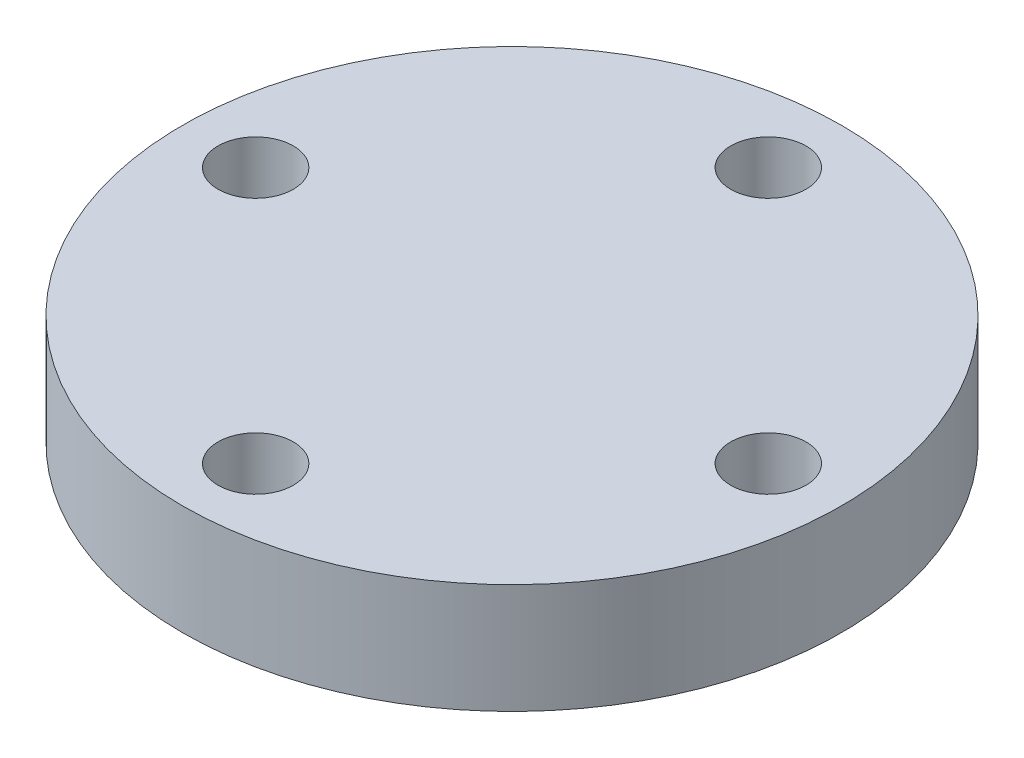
from build123d import *

# Parameters (mm, degrees)
SKETCH1_R           = 28.575
BOSS_EXTRUDE1_DEPTH = 9.525
SKETCH2_R           = 3.2639
CUT_EXTRUDE1_DEPTH  = 42.518512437


with BuildPart() as part:
    # Sketch1 → Boss-Extrude1 (new body)
    with BuildSketch(Plane(origin=(0, 0, 0), x_dir=(1, 0, 0), z_dir=(0, 1, 0))):
        with Locations(Location((0, 0, 0), (0, 0, 90))):
            Circle(SKETCH1_R)
    extrude(amount=BOSS_EXTRUDE1_DEPTH)

    # Sketch2 → Cut-Extrude1 (cut, through all)
    with BuildSketch(Plane(origin=(0, 9.525, 0), x_dir=(1, 0, 0), z_dir=(0, 1, 0))):
        with Locations(Location((0, 22.225, 0), (0, 0, 270))):
            Circle(SKETCH2_R)
        with Locations(Location((22.225, 0, 0), (0, 0, 270))):
            Circle(SKETCH2_R)
        with Locations(Location((0, -22.225, 0), (0, 0, 270))):
            Circle(SKETCH2_R)
        with Locations(Location((-22.225, 0, 0), (0, 0, 270))):
            Circle(SKETCH2_R)
    extrude(amount=-CUT_EXTRUDE1_DEPTH, mode=Mode.SUBTRACT)


solid = part.part
